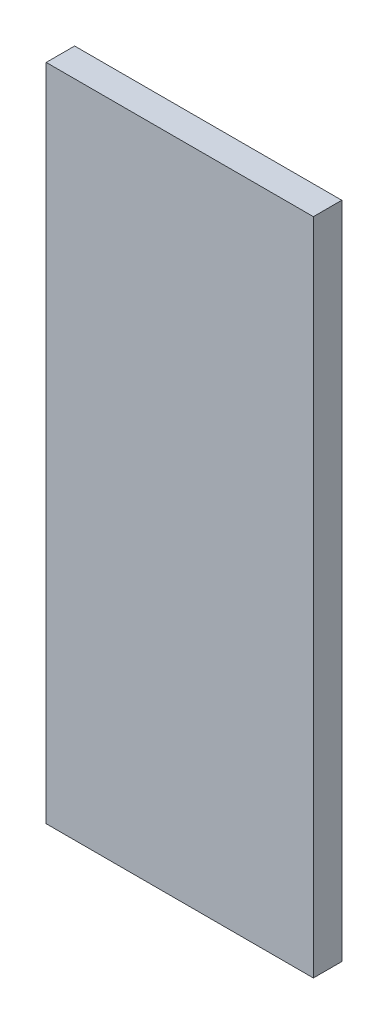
ISO-10303-21;
HEADER;
FILE_DESCRIPTION(('STEP AP214'),'2;1');
FILE_NAME('part.step','',(''),(''),'','','');
FILE_SCHEMA(('AUTOMOTIVE_DESIGN { 1 0 10303 214 1 1 1 1 }'));
ENDSEC;
DATA;
#1=APPLICATION_CONTEXT('core data for automotive mechanical design processes');
#2=APPLICATION_PROTOCOL_DEFINITION('international standard','automotive_design',2000,#1);
#3=PRODUCT_CONTEXT('',#1,'mechanical');
#4=PRODUCT('Part','Part','',(#3));
#5=PRODUCT_RELATED_PRODUCT_CATEGORY('part','',(#4));
#6=PRODUCT_DEFINITION_FORMATION('','',#4);
#7=PRODUCT_DEFINITION_CONTEXT('part definition',#1,'design');
#8=PRODUCT_DEFINITION('design','',#6,#7);
#9=PRODUCT_DEFINITION_SHAPE('','',#8);
#10=(LENGTH_UNIT() NAMED_UNIT(*) SI_UNIT(.MILLI.,.METRE.));
#11=(NAMED_UNIT(*) PLANE_ANGLE_UNIT() SI_UNIT($,.RADIAN.));
#12=(NAMED_UNIT(*) SI_UNIT($,.STERADIAN.) SOLID_ANGLE_UNIT());
#13=UNCERTAINTY_MEASURE_WITH_UNIT(LENGTH_MEASURE(1.E-05),#10,'distance_accuracy_value','');
#14=(GEOMETRIC_REPRESENTATION_CONTEXT(3) GLOBAL_UNCERTAINTY_ASSIGNED_CONTEXT((#13)) GLOBAL_UNIT_ASSIGNED_CONTEXT((#10,
#11,#12)) REPRESENTATION_CONTEXT('',''));
#15=CARTESIAN_POINT('',(0.,0.,0.));
#16=DIRECTION('',(0.,0.,1.));
#17=DIRECTION('',(1.,0.,0.));
#18=AXIS2_PLACEMENT_3D('',#15,#16,#17);
#19=CARTESIAN_POINT('',(0.,-1154.,5.));
#20=DIRECTION('',(-1.,0.,0.));
#21=DIRECTION('',(0.,-1.,0.));
#22=AXIS2_PLACEMENT_3D('',#19,#20,#21);
#23=PLANE('',#22);
#24=DIRECTION('',(0.,1.,0.));
#25=VECTOR('',#24,1.);
#26=CARTESIAN_POINT('',(0.,-1154.,0.));
#27=LINE('',#26,#25);
#28=CARTESIAN_POINT('',(0.,-1270.,0.));
#29=VERTEX_POINT('',#28);
#30=CARTESIAN_POINT('',(0.,-1154.,0.));
#31=VERTEX_POINT('',#30);
#32=EDGE_CURVE('E96',#29,#31,#27,.T.);
#33=ORIENTED_EDGE('',*,*,#32,.T.);
#34=DIRECTION('',(0.,0.,-1.));
#35=VECTOR('',#34,1.);
#36=CARTESIAN_POINT('',(0.,-1154.,5.));
#37=LINE('',#36,#35);
#38=CARTESIAN_POINT('',(0.,-1154.,5.));
#39=VERTEX_POINT('',#38);
#40=EDGE_CURVE('E11',#39,#31,#37,.T.);
#41=ORIENTED_EDGE('',*,*,#40,.F.);
#42=DIRECTION('',(0.,1.,0.));
#43=VECTOR('',#42,1.);
#44=CARTESIAN_POINT('',(0.,-1154.,5.));
#45=LINE('',#44,#43);
#46=CARTESIAN_POINT('',(0.,-1270.,5.));
#47=VERTEX_POINT('',#46);
#48=EDGE_CURVE('E84',#47,#39,#45,.T.);
#49=ORIENTED_EDGE('',*,*,#48,.F.);
#50=DIRECTION('',(0.,0.,-1.));
#51=VECTOR('',#50,1.);
#52=CARTESIAN_POINT('',(0.,-1270.,5.));
#53=LINE('',#52,#51);
#54=EDGE_CURVE('E92',#47,#29,#53,.T.);
#55=ORIENTED_EDGE('',*,*,#54,.T.);
#56=EDGE_LOOP('',(#33,#41,#49,#55));
#57=FACE_BOUND('',#56,.T.);
#58=ADVANCED_FACE('F33',(#57),#23,.F.);
#59=CARTESIAN_POINT('',(-47.,-1154.,5.));
#60=DIRECTION('',(0.,-1.,0.));
#61=DIRECTION('',(0.,0.,-1.));
#62=AXIS2_PLACEMENT_3D('',#59,#60,#61);
#63=PLANE('',#62);
#64=DIRECTION('',(-1.,0.,0.));
#65=VECTOR('',#64,1.);
#66=CARTESIAN_POINT('',(-47.,-1154.,0.));
#67=LINE('',#66,#65);
#68=CARTESIAN_POINT('',(-47.,-1154.,0.));
#69=VERTEX_POINT('',#68);
#70=EDGE_CURVE('E88',#31,#69,#67,.T.);
#71=ORIENTED_EDGE('',*,*,#70,.T.);
#72=DIRECTION('',(0.,0.,-1.));
#73=VECTOR('',#72,1.);
#74=CARTESIAN_POINT('',(-47.,-1154.,5.));
#75=LINE('',#74,#73);
#76=CARTESIAN_POINT('',(-47.,-1154.,5.));
#77=VERTEX_POINT('',#76);
#78=EDGE_CURVE('E41',#77,#69,#75,.T.);
#79=ORIENTED_EDGE('',*,*,#78,.F.);
#80=DIRECTION('',(-1.,0.,0.));
#81=VECTOR('',#80,1.);
#82=CARTESIAN_POINT('',(-47.,-1154.,5.));
#83=LINE('',#82,#81);
#84=EDGE_CURVE('E79',#39,#77,#83,.T.);
#85=ORIENTED_EDGE('',*,*,#84,.F.);
#86=ORIENTED_EDGE('',*,*,#40,.T.);
#87=EDGE_LOOP('',(#71,#79,#85,#86));
#88=FACE_BOUND('',#87,.T.);
#89=ADVANCED_FACE('F87',(#88),#63,.F.);
#90=CARTESIAN_POINT('',(-47.,-1154.,5.));
#91=DIRECTION('',(1.,0.,0.));
#92=DIRECTION('',(0.,1.,0.));
#93=AXIS2_PLACEMENT_3D('',#90,#91,#92);
#94=PLANE('',#93);
#95=DIRECTION('',(0.,-1.,0.));
#96=VECTOR('',#95,1.);
#97=CARTESIAN_POINT('',(-47.,-1154.,0.));
#98=LINE('',#97,#96);
#99=CARTESIAN_POINT('',(-46.9999999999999,-1270.,0.));
#100=VERTEX_POINT('',#99);
#101=EDGE_CURVE('E66',#69,#100,#98,.T.);
#102=ORIENTED_EDGE('',*,*,#101,.T.);
#103=DIRECTION('',(0.,0.,-1.));
#104=VECTOR('',#103,1.);
#105=CARTESIAN_POINT('',(-46.9999999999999,-1270.,5.));
#106=LINE('',#105,#104);
#107=CARTESIAN_POINT('',(-46.9999999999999,-1270.,5.));
#108=VERTEX_POINT('',#107);
#109=EDGE_CURVE('E89',#108,#100,#106,.T.);
#110=ORIENTED_EDGE('',*,*,#109,.F.);
#111=DIRECTION('',(0.,-1.,0.));
#112=VECTOR('',#111,1.);
#113=CARTESIAN_POINT('',(-47.,-1154.,5.));
#114=LINE('',#113,#112);
#115=EDGE_CURVE('E82',#77,#108,#114,.T.);
#116=ORIENTED_EDGE('',*,*,#115,.F.);
#117=ORIENTED_EDGE('',*,*,#78,.T.);
#118=EDGE_LOOP('',(#102,#110,#116,#117));
#119=FACE_BOUND('',#118,.T.);
#120=ADVANCED_FACE('F90',(#119),#94,.F.);
#121=CARTESIAN_POINT('',(-46.9999999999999,-1270.,5.));
#122=DIRECTION('',(0.,1.,0.));
#123=DIRECTION('',(0.,0.,1.));
#124=AXIS2_PLACEMENT_3D('',#121,#122,#123);
#125=PLANE('',#124);
#126=DIRECTION('',(1.,0.,0.));
#127=VECTOR('',#126,1.);
#128=CARTESIAN_POINT('',(-46.9999999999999,-1270.,0.));
#129=LINE('',#128,#127);
#130=EDGE_CURVE('E72',#100,#29,#129,.T.);
#131=ORIENTED_EDGE('',*,*,#130,.T.);
#132=ORIENTED_EDGE('',*,*,#54,.F.);
#133=DIRECTION('',(1.,0.,0.));
#134=VECTOR('',#133,1.);
#135=CARTESIAN_POINT('',(-46.9999999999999,-1270.,5.));
#136=LINE('',#135,#134);
#137=EDGE_CURVE('E49',#108,#47,#136,.T.);
#138=ORIENTED_EDGE('',*,*,#137,.F.);
#139=ORIENTED_EDGE('',*,*,#109,.T.);
#140=EDGE_LOOP('',(#131,#132,#138,#139));
#141=FACE_BOUND('',#140,.T.);
#142=ADVANCED_FACE('F103',(#141),#125,.F.);
#143=CARTESIAN_POINT('',(0.,0.,5.));
#144=DIRECTION('',(0.,0.,1.));
#145=DIRECTION('',(1.,0.,0.));
#146=AXIS2_PLACEMENT_3D('',#143,#144,#145);
#147=PLANE('',#146);
#148=ORIENTED_EDGE('',*,*,#48,.T.);
#149=ORIENTED_EDGE('',*,*,#84,.T.);
#150=ORIENTED_EDGE('',*,*,#115,.T.);
#151=ORIENTED_EDGE('',*,*,#137,.T.);
#152=EDGE_LOOP('',(#148,#149,#150,#151));
#153=FACE_BOUND('',#152,.T.);
#154=ADVANCED_FACE('F80',(#153),#147,.T.);
#155=CARTESIAN_POINT('',(0.,0.,0.));
#156=DIRECTION('',(0.,0.,1.));
#157=DIRECTION('',(1.,0.,0.));
#158=AXIS2_PLACEMENT_3D('',#155,#156,#157);
#159=PLANE('',#158);
#160=ORIENTED_EDGE('',*,*,#32,.F.);
#161=ORIENTED_EDGE('',*,*,#130,.F.);
#162=ORIENTED_EDGE('',*,*,#101,.F.);
#163=ORIENTED_EDGE('',*,*,#70,.F.);
#164=EDGE_LOOP('',(#160,#161,#162,#163));
#165=FACE_BOUND('',#164,.T.);
#166=ADVANCED_FACE('F106',(#165),#159,.F.);
#167=CLOSED_SHELL('',(#58,#89,#120,#142,#154,#166));
#168=MANIFOLD_SOLID_BREP('B2',#167);
#169=ADVANCED_BREP_SHAPE_REPRESENTATION('',(#18,#168),#14);
#170=SHAPE_DEFINITION_REPRESENTATION(#9,#169);
ENDSEC;
END-ISO-10303-21;
